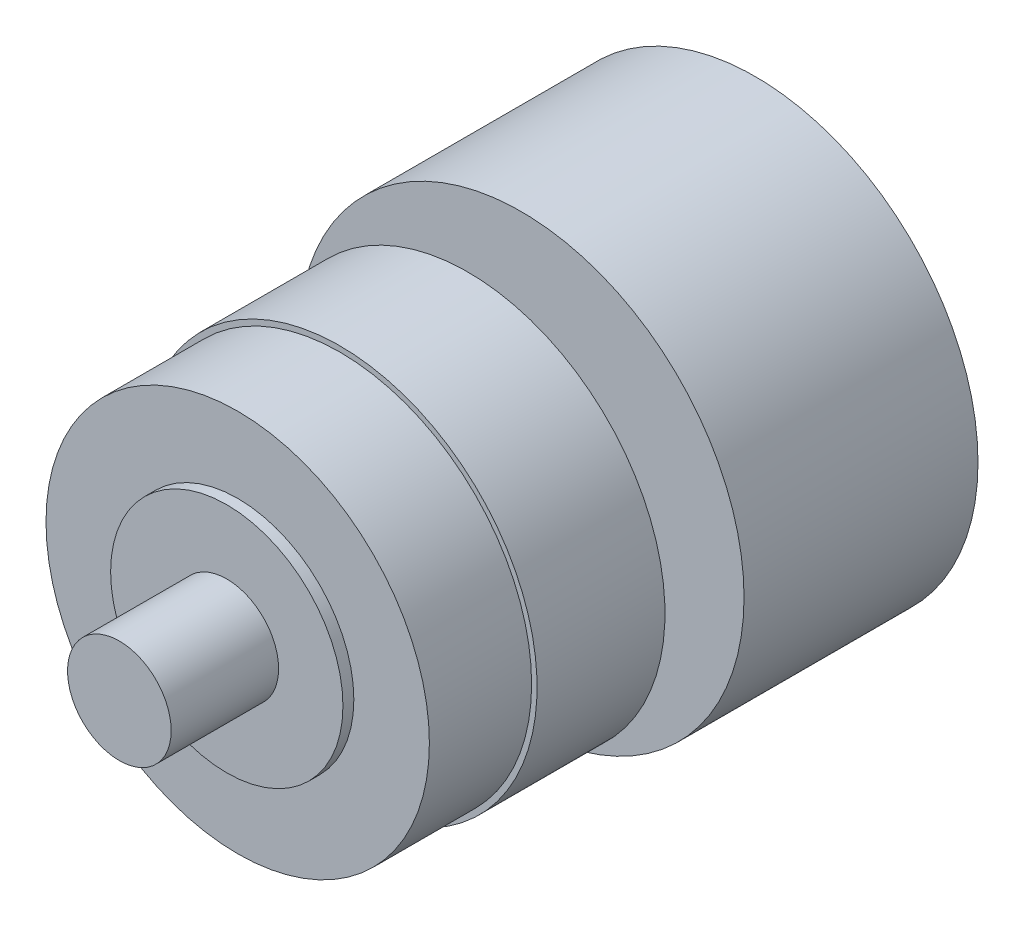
from build123d import *

# Parameters (mm, degrees)
SKETCH1_R          = 2.413
EXTRUDE1_DEPTH     = 5.0038
SKETCH2_R          = 5.4102
EXTRUDE2_DEPTH     = 0.508
SKETCH3_R          = 8.9281
EXTRUDE3_DEPTH     = 4.7625
SKETCH4_R          = 9.1821
EXTRUDE4_DEPTH     = 5.9563
SKETCH6_R          = 6.35
EXTRUDE5_DEPTH     = 2.2352
EXTRUDE5_TAPER     = 45
SKETCH7_R          = 4.1148
EXTRUDE6_DEPTH     = 0.254
SKETCH8_R          = 10.3759
EXTRUDE7_DEPTH     = 10.8966
SKETCH9_R          = 5.08
EXTRUDE8_DEPTH     = 0.127
EXTRUDE9_DEPTH     = 1.524
SKETCH11_OUTSIDE_W = 34.376
SKETCH11_OUTSIDE_H = 34.376
SKETCH11_OUTSIDE_R = 6.3373
CUT_EXTRUDE1_DEPTH = 1.524
CUT_EXTRUDE1_DRAFT = -45


with BuildPart() as part:
    # Sketch1 → Extrude1 (new body)
    with BuildSketch(Plane.XY):
        Circle(SKETCH1_R)
    extrude(amount=-EXTRUDE1_DEPTH)

    # Sketch2 → Extrude2 (add)
    with BuildSketch(Plane(origin=(0, 0, -5.0038), x_dir=(-1, 0, 0), z_dir=(0, 0, -1))):
        Circle(SKETCH2_R)
    extrude(amount=EXTRUDE2_DEPTH)

    # Sketch3 → Extrude3 (add)
    with BuildSketch(Plane(origin=(0, 0, -5.5118), x_dir=(-1, 0, 0), z_dir=(0, 0, -1))):
        with Locations(Location((0, 0, 0), (0, 0, 180))):
            Circle(SKETCH3_R)
    extrude(amount=EXTRUDE3_DEPTH)

    # Sketch4 → Extrude4 (add)
    with BuildSketch(Plane(origin=(0, 0, -10.2743), x_dir=(-1, 0, 0), z_dir=(0, 0, -1))):
        Circle(SKETCH4_R)
    extrude(amount=EXTRUDE4_DEPTH)

    # Sketch6 → Extrude5 (add)
    with BuildSketch(Plane(origin=(0, 0, -16.2306), x_dir=(-1, 0, 0), z_dir=(0, 0, -1))):
        Circle(SKETCH6_R)
    extrude(amount=EXTRUDE5_DEPTH, taper=EXTRUDE5_TAPER)

    # Sketch7 → Extrude6 (add)
    with BuildSketch(Plane(origin=(0, 0, -18.4658), x_dir=(-1, 0, 0), z_dir=(0, 0, -1))):
        Circle(SKETCH7_R)
    extrude(amount=EXTRUDE6_DEPTH)

    # Sketch8 → Extrude7 (add)
    with BuildSketch(Plane(origin=(0, 0, -18.7198), x_dir=(-1, 0, 0), z_dir=(0, 0, -1))):
        Circle(SKETCH8_R)
    extrude(amount=EXTRUDE7_DEPTH)

    # Sketch9 → Extrude8 (add)
    with BuildSketch(Plane(origin=(0, 0, -29.6164), x_dir=(-1, 0, 0), z_dir=(0, 0, -1))):
        Circle(SKETCH9_R)
    extrude(amount=EXTRUDE8_DEPTH)

    # Sketch10 → Extrude9 (add)
    with BuildSketch(Plane(origin=(0, 0, -29.7434), x_dir=(-1, 0, 0), z_dir=(0, 0, -1))):
        Polygon((7.332348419, 0), (3.666174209, 6.35), (-3.666174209, 6.35), (-7.332348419, 0), (-3.666174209, -6.35), (3.666174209, -6.35), align=None)
    extrude(amount=EXTRUDE9_DEPTH)


with BuildPart() as cut_extrude1_tool:
    # Sketch11 outside → Cut-Extrude1 (with draft: the straight prism first)
    with BuildSketch(Plane(origin=(0, 0, -31.2674), x_dir=(-1, 0, 0), z_dir=(0, 0, -1))):
        Rectangle(SKETCH11_OUTSIDE_W, SKETCH11_OUTSIDE_H)
        Circle(SKETCH11_OUTSIDE_R, mode=Mode.SUBTRACT)
    extrude(amount=-CUT_EXTRUDE1_DEPTH)
    # Cut-Extrude1: the draft: its side faces are tilted about the plane it starts from
    cut_extrude1_sides = [cut_extrude1_tool.faces().sort_by_distance(p)[0] for p in [
        (0, -17.188, -30.5054),
        (-17.188, 0, -30.5054),
        (0, 17.188, -30.5054),
        (17.188, 0, -30.5054),
        (6.3373, 0, -30.5054),
    ]]
    draft(cut_extrude1_sides, Plane(origin=(0, 0, -31.2674), x_dir=(-1, 0, 0), z_dir=(0, 0, -1)), CUT_EXTRUDE1_DRAFT)


with BuildPart() as part_1:
    add(part.part)

    # Cut-Extrude1: cut by cut_extrude1_tool
    add(cut_extrude1_tool.part, mode=Mode.SUBTRACT)


solid = part_1.part
